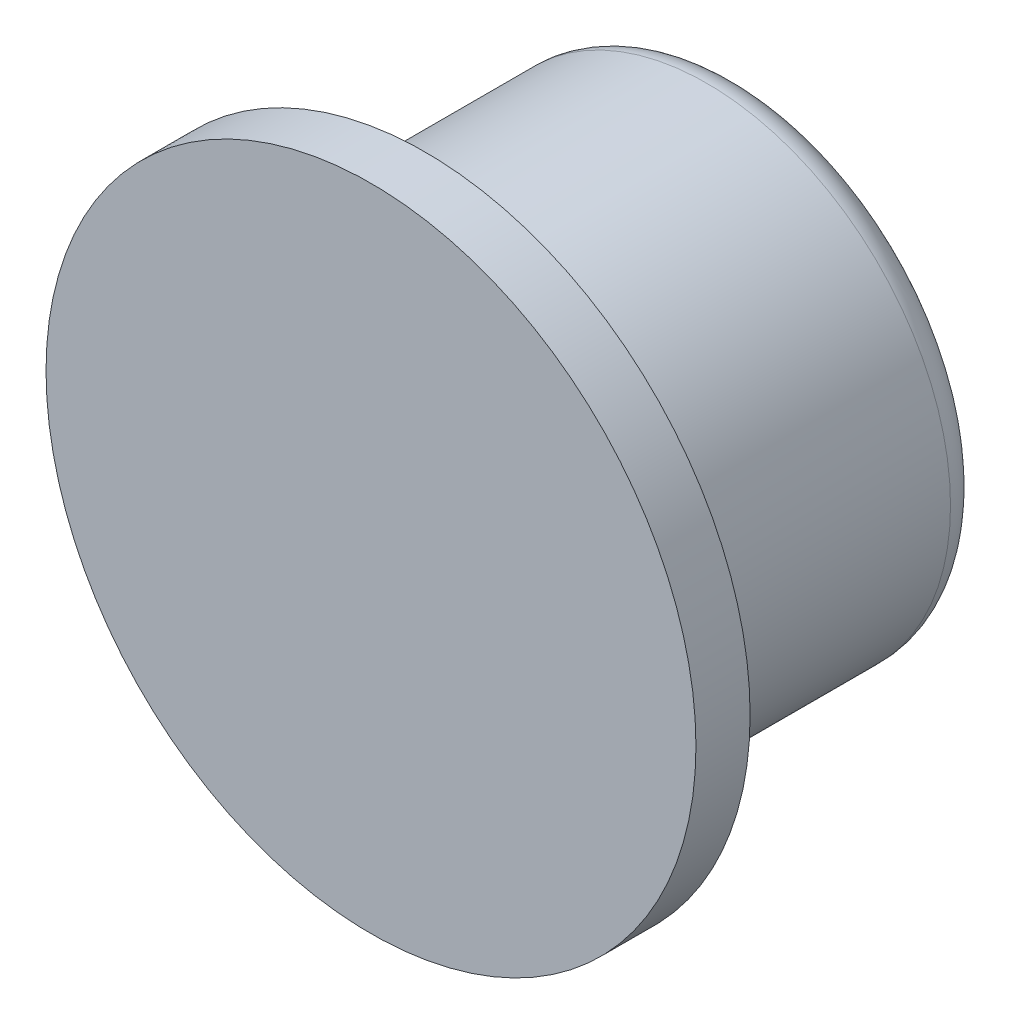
ISO-10303-21;
HEADER;
FILE_DESCRIPTION(('STEP AP214'),'2;1');
FILE_NAME('part.step','',(''),(''),'','','');
FILE_SCHEMA(('AUTOMOTIVE_DESIGN { 1 0 10303 214 1 1 1 1 }'));
ENDSEC;
DATA;
#1=APPLICATION_CONTEXT('core data for automotive mechanical design processes');
#2=APPLICATION_PROTOCOL_DEFINITION('international standard','automotive_design',2000,#1);
#3=PRODUCT_CONTEXT('',#1,'mechanical');
#4=PRODUCT('Part','Part','',(#3));
#5=PRODUCT_RELATED_PRODUCT_CATEGORY('part','',(#4));
#6=PRODUCT_DEFINITION_FORMATION('','',#4);
#7=PRODUCT_DEFINITION_CONTEXT('part definition',#1,'design');
#8=PRODUCT_DEFINITION('design','',#6,#7);
#9=PRODUCT_DEFINITION_SHAPE('','',#8);
#10=(LENGTH_UNIT() NAMED_UNIT(*) SI_UNIT(.MILLI.,.METRE.));
#11=(NAMED_UNIT(*) PLANE_ANGLE_UNIT() SI_UNIT($,.RADIAN.));
#12=(NAMED_UNIT(*) SI_UNIT($,.STERADIAN.) SOLID_ANGLE_UNIT());
#13=UNCERTAINTY_MEASURE_WITH_UNIT(LENGTH_MEASURE(1.E-05),#10,'distance_accuracy_value','');
#14=(GEOMETRIC_REPRESENTATION_CONTEXT(3) GLOBAL_UNCERTAINTY_ASSIGNED_CONTEXT((#13)) GLOBAL_UNIT_ASSIGNED_CONTEXT((#10,
#11,#12)) REPRESENTATION_CONTEXT('',''));
#15=CARTESIAN_POINT('',(0.,0.,0.));
#16=DIRECTION('',(0.,0.,1.));
#17=DIRECTION('',(1.,0.,0.));
#18=AXIS2_PLACEMENT_3D('',#15,#16,#17);
#19=CARTESIAN_POINT('',(0.,0.,0.));
#20=DIRECTION('',(0.,0.,1.));
#21=DIRECTION('',(1.,0.,0.));
#22=AXIS2_PLACEMENT_3D('',#19,#20,#21);
#23=PLANE('',#22);
#24=CARTESIAN_POINT('',(0.,0.,0.));
#25=DIRECTION('',(0.,0.,-1.));
#26=DIRECTION('',(-1.,0.,0.));
#27=AXIS2_PLACEMENT_3D('',#24,#25,#26);
#28=CIRCLE('',#27,30.);
#29=CARTESIAN_POINT('',(-30.,0.,0.));
#30=VERTEX_POINT('',#29);
#31=EDGE_CURVE('E11',#30,#30,#28,.T.);
#32=ORIENTED_EDGE('',*,*,#31,.F.);
#33=EDGE_LOOP('',(#32));
#34=FACE_BOUND('',#33,.T.);
#35=ADVANCED_FACE('F32',(#34),#23,.T.);
#36=CARTESIAN_POINT('',(0.,0.,-22.6905989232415));
#37=DIRECTION('',(0.,0.,-1.));
#38=DIRECTION('',(-1.,0.,0.));
#39=AXIS2_PLACEMENT_3D('',#36,#37,#38);
#40=CYLINDRICAL_SURFACE('',#39,30.);
#41=ORIENTED_EDGE('',*,*,#31,.T.);
#42=EDGE_LOOP('',(#41));
#43=FACE_BOUND('',#42,.T.);
#44=CARTESIAN_POINT('',(0.,0.,-5.));
#45=DIRECTION('',(0.,0.,-1.));
#46=DIRECTION('',(-1.,0.,0.));
#47=AXIS2_PLACEMENT_3D('',#44,#45,#46);
#48=CIRCLE('',#47,30.);
#49=CARTESIAN_POINT('',(-30.,0.,-5.));
#50=VERTEX_POINT('',#49);
#51=EDGE_CURVE('E38',#50,#50,#48,.T.);
#52=ORIENTED_EDGE('',*,*,#51,.F.);
#53=EDGE_LOOP('',(#52));
#54=FACE_BOUND('',#53,.T.);
#55=ADVANCED_FACE('F54',(#43,#54),#40,.T.);
#56=CARTESIAN_POINT('',(0.,30.,-5.));
#57=DIRECTION('',(0.,0.,-1.));
#58=DIRECTION('',(-1.,0.,0.));
#59=AXIS2_PLACEMENT_3D('',#56,#57,#58);
#60=PLANE('',#59);
#61=ORIENTED_EDGE('',*,*,#51,.T.);
#62=EDGE_LOOP('',(#61));
#63=FACE_BOUND('',#62,.T.);
#64=CARTESIAN_POINT('',(0.,0.,-5.));
#65=DIRECTION('',(0.,0.,-1.));
#66=DIRECTION('',(-1.,0.,0.));
#67=AXIS2_PLACEMENT_3D('',#64,#65,#66);
#68=CIRCLE('',#67,22.5);
#69=CARTESIAN_POINT('',(-22.5,0.,-5.));
#70=VERTEX_POINT('',#69);
#71=EDGE_CURVE('E66',#70,#70,#68,.T.);
#72=ORIENTED_EDGE('',*,*,#71,.F.);
#73=EDGE_LOOP('',(#72));
#74=FACE_BOUND('',#73,.T.);
#75=ADVANCED_FACE('F59',(#63,#74),#60,.T.);
#76=CARTESIAN_POINT('',(0.,0.,-22.6905989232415));
#77=DIRECTION('',(0.,0.,-1.));
#78=DIRECTION('',(-1.,0.,0.));
#79=AXIS2_PLACEMENT_3D('',#76,#77,#78);
#80=CYLINDRICAL_SURFACE('',#79,22.5);
#81=ORIENTED_EDGE('',*,*,#71,.T.);
#82=EDGE_LOOP('',(#81));
#83=FACE_BOUND('',#82,.T.);
#84=CARTESIAN_POINT('',(0.,0.,-31.));
#85=DIRECTION('',(0.,0.,-1.));
#86=DIRECTION('',(-1.,0.,0.));
#87=AXIS2_PLACEMENT_3D('',#84,#85,#86);
#88=CIRCLE('',#87,22.5);
#89=CARTESIAN_POINT('',(-22.5,0.,-31.));
#90=VERTEX_POINT('',#89);
#91=EDGE_CURVE('E68',#90,#90,#88,.T.);
#92=ORIENTED_EDGE('',*,*,#91,.F.);
#93=EDGE_LOOP('',(#92));
#94=FACE_BOUND('',#93,.T.);
#95=ADVANCED_FACE('F100',(#83,#94),#80,.T.);
#96=CARTESIAN_POINT('',(0.,0.,-31.));
#97=DIRECTION('',(0.,0.,-1.));
#98=DIRECTION('',(-1.,0.,0.));
#99=AXIS2_PLACEMENT_3D('',#96,#97,#98);
#100=TOROIDAL_SURFACE('',#99,19.5,3.);
#101=ORIENTED_EDGE('',*,*,#91,.T.);
#102=EDGE_LOOP('',(#101));
#103=FACE_BOUND('',#102,.T.);
#104=CARTESIAN_POINT('',(0.,0.,-34.));
#105=DIRECTION('',(0.,0.,-1.));
#106=DIRECTION('',(-1.,0.,0.));
#107=AXIS2_PLACEMENT_3D('',#104,#105,#106);
#108=CIRCLE('',#107,19.5);
#109=CARTESIAN_POINT('',(-19.5,0.,-34.));
#110=VERTEX_POINT('',#109);
#111=EDGE_CURVE('E73',#110,#110,#108,.T.);
#112=ORIENTED_EDGE('',*,*,#111,.F.);
#113=EDGE_LOOP('',(#112));
#114=FACE_BOUND('',#113,.T.);
#115=ADVANCED_FACE('F94',(#103,#114),#100,.T.);
#116=CARTESIAN_POINT('',(0.,19.5,-34.));
#117=DIRECTION('',(0.,0.,-1.));
#118=DIRECTION('',(-1.,0.,0.));
#119=AXIS2_PLACEMENT_3D('',#116,#117,#118);
#120=PLANE('',#119);
#121=ORIENTED_EDGE('',*,*,#111,.T.);
#122=EDGE_LOOP('',(#121));
#123=FACE_BOUND('',#122,.T.);
#124=CARTESIAN_POINT('',(0.,0.,-34.));
#125=DIRECTION('',(0.,0.,-1.));
#126=DIRECTION('',(-1.,0.,0.));
#127=AXIS2_PLACEMENT_3D('',#124,#125,#126);
#128=CIRCLE('',#127,4.5);
#129=CARTESIAN_POINT('',(-4.5,0.,-34.));
#130=VERTEX_POINT('',#129);
#131=EDGE_CURVE('E76',#130,#130,#128,.T.);
#132=ORIENTED_EDGE('',*,*,#131,.F.);
#133=EDGE_LOOP('',(#132));
#134=FACE_BOUND('',#133,.T.);
#135=ADVANCED_FACE('F88',(#123,#134),#120,.T.);
#136=CARTESIAN_POINT('',(0.,0.,-33.5));
#137=DIRECTION('',(0.,0.,-1.));
#138=DIRECTION('',(-1.,0.,0.));
#139=AXIS2_PLACEMENT_3D('',#136,#137,#138);
#140=CONICAL_SURFACE('',#139,4.,0.785398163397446);
#141=ORIENTED_EDGE('',*,*,#131,.T.);
#142=EDGE_LOOP('',(#141));
#143=FACE_BOUND('',#142,.T.);
#144=CARTESIAN_POINT('',(0.,0.,-33.5));
#145=DIRECTION('',(0.,0.,-1.));
#146=DIRECTION('',(-1.,0.,0.));
#147=AXIS2_PLACEMENT_3D('',#144,#145,#146);
#148=CIRCLE('',#147,4.);
#149=CARTESIAN_POINT('',(-4.,0.,-33.5));
#150=VERTEX_POINT('',#149);
#151=EDGE_CURVE('E79',#150,#150,#148,.T.);
#152=ORIENTED_EDGE('',*,*,#151,.F.);
#153=EDGE_LOOP('',(#152));
#154=FACE_BOUND('',#153,.T.);
#155=ADVANCED_FACE('F49',(#143,#154),#140,.F.);
#156=CARTESIAN_POINT('',(0.,0.,-22.6905989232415));
#157=DIRECTION('',(0.,0.,-1.));
#158=DIRECTION('',(-1.,0.,0.));
#159=AXIS2_PLACEMENT_3D('',#156,#157,#158);
#160=CYLINDRICAL_SURFACE('',#159,4.);
#161=ORIENTED_EDGE('',*,*,#151,.T.);
#162=EDGE_LOOP('',(#161));
#163=FACE_BOUND('',#162,.T.);
#164=CARTESIAN_POINT('',(0.,0.,-25.));
#165=DIRECTION('',(0.,0.,-1.));
#166=DIRECTION('',(-1.,0.,0.));
#167=AXIS2_PLACEMENT_3D('',#164,#165,#166);
#168=CIRCLE('',#167,4.);
#169=CARTESIAN_POINT('',(-4.,0.,-25.));
#170=VERTEX_POINT('',#169);
#171=EDGE_CURVE('E82',#170,#170,#168,.T.);
#172=ORIENTED_EDGE('',*,*,#171,.F.);
#173=EDGE_LOOP('',(#172));
#174=FACE_BOUND('',#173,.T.);
#175=ADVANCED_FACE('F43',(#163,#174),#160,.F.);
#176=CARTESIAN_POINT('',(0.,0.,-22.6905989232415));
#177=DIRECTION('',(0.,0.,-1.));
#178=DIRECTION('',(-1.,0.,0.));
#179=AXIS2_PLACEMENT_3D('',#176,#177,#178);
#180=CONICAL_SURFACE('',#179,0.,1.0471975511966);
#181=ORIENTED_EDGE('',*,*,#171,.T.);
#182=EDGE_LOOP('',(#181));
#183=FACE_BOUND('',#182,.T.);
#184=CARTESIAN_POINT('',(0.,0.,-22.6905989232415));
#185=VERTEX_POINT('',#184);
#186=VERTEX_LOOP('',#185);
#187=FACE_BOUND('',#186,.T.);
#188=ADVANCED_FACE('F41',(#183,#187),#180,.F.);
#189=CLOSED_SHELL('',(#35,#55,#75,#95,#115,#135,#155,#175,#188));
#190=MANIFOLD_SOLID_BREP('B2',#189);
#191=ADVANCED_BREP_SHAPE_REPRESENTATION('',(#18,#190),#14);
#192=SHAPE_DEFINITION_REPRESENTATION(#9,#191);
ENDSEC;
END-ISO-10303-21;
